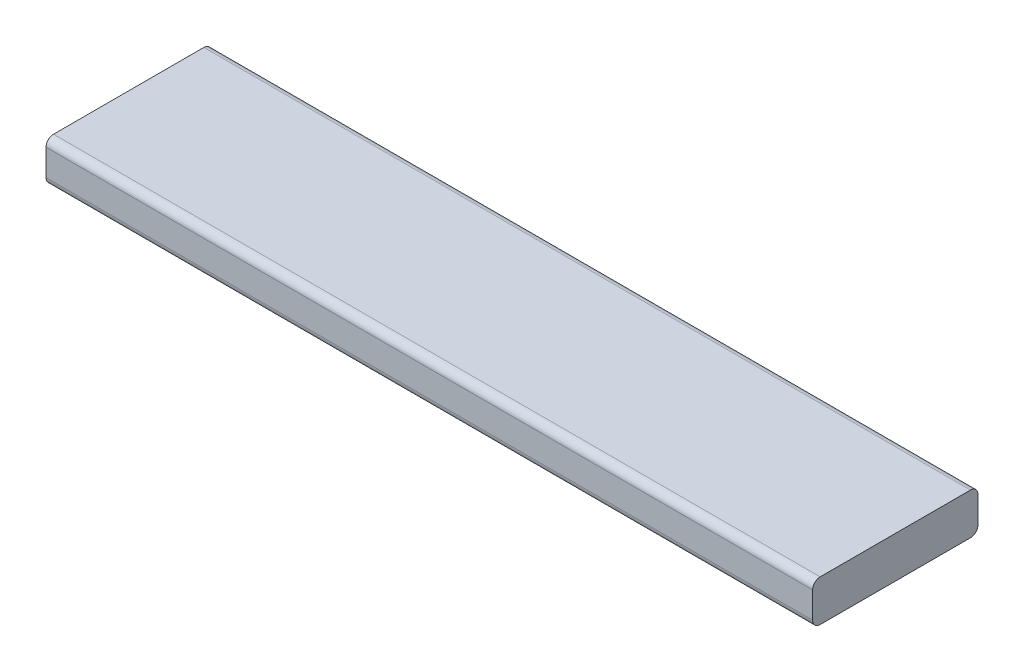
from build123d import *

# Parameters (mm, degrees)
SKETCH2_W           = 139.7
SKETCH2_H           = 34.925
BOSS_EXTRUDE1_DEPTH = 647.7
FILLET1_R           = 6.35


with BuildPart() as part:
    # Sketch2 → Boss-Extrude1 (new body)
    with BuildSketch(Plane(origin=(0, 0, 0), x_dir=(0, 0, -1), z_dir=(1, 0, 0))):
        with Locations((-69.85, 17.4625)):
            Rectangle(SKETCH2_W, SKETCH2_H)
    extrude(amount=BOSS_EXTRUDE1_DEPTH)

    # Fillet1
    fillet1_edges = [part.edges().sort_by_distance(p)[0] for p in [
        (323.85, 34.925, 139.7),
        (323.85, 0, 139.7),
        (323.85, 0, 0),
        (323.85, 34.925, 0),
    ]]
    fillet(fillet1_edges, radius=FILLET1_R)


solid = part.part
